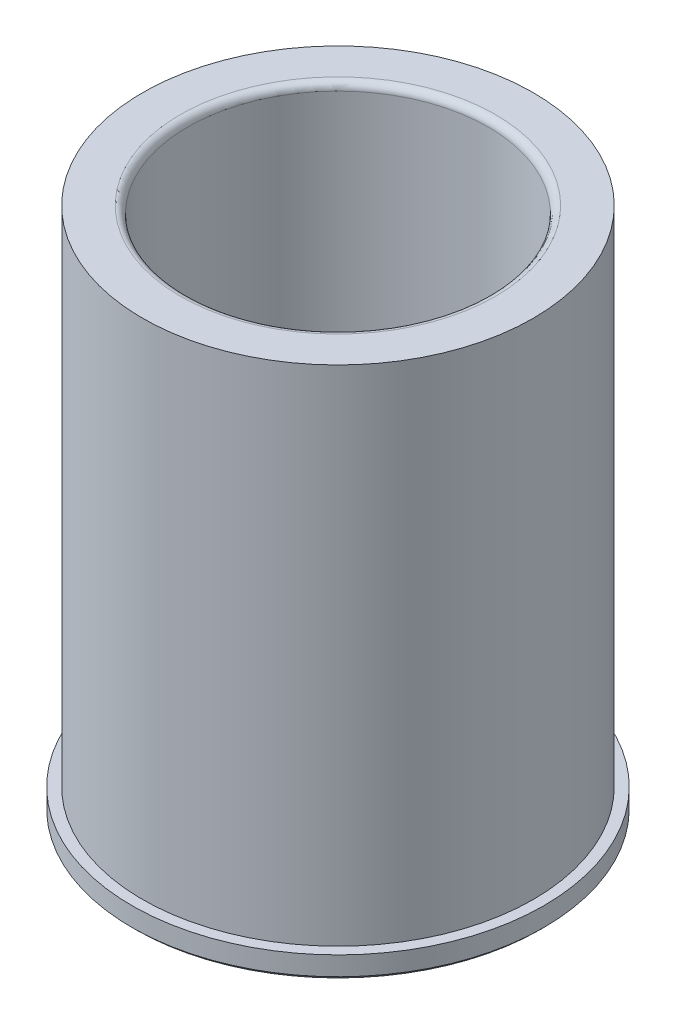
from build123d import *

# Parameters (mm, degrees)
FILLET1_R = 1.524


with BuildPart() as part:
    # Sketch1 → Revolve1 (revolve)
    with BuildSketch(Plane.XY, mode=Mode.PRIVATE) as revolve1_sk:
        Polygon((-42.7609, 0), (-43.5229, 0.762), (-43.5229, 4.7625), (-41.28135, 4.7625), (-41.28135, 111.125), (-31.75635, 111.125), (-31.75635, 0.762), (-32.51835, 0), align=None)
    revolve(revolve1_sk.sketch.rotate(Axis((0, -1000, 0), (0, 1, 0)), 180), axis=Axis((0, -1000, 0), (0, 1, 0)))

    # Fillet1
    fillet1_edges = [part.edges().sort_by_distance(p)[0] for p in [
        (-31.75635, 111.125, 0),
    ]]
    fillet(fillet1_edges, radius=FILLET1_R)


solid = part.part
